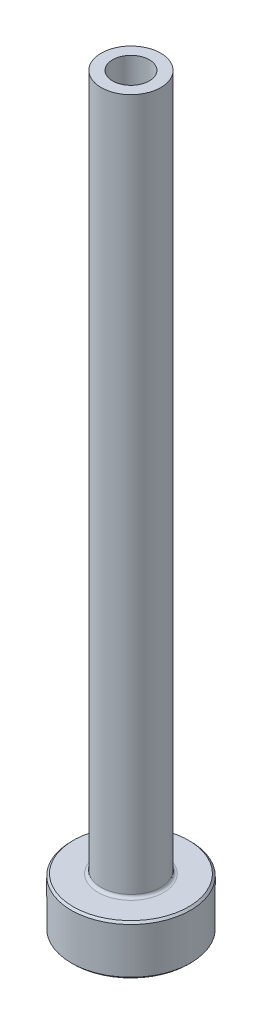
from build123d import *

# Parameters (mm, degrees)
FILLET1_R     = 0.3
CHAMFER1_SIZE = 0.2
CHAMFER3_SIZE = 0.5


with BuildPart() as part:
    # Sketch1 → Revolve1 (revolve)
    with BuildSketch(Plane.XY, mode=Mode.PRIVATE) as revolve1_sk:
        Polygon((-1.85, 75), (-3, 75), (-3, 5), (-6, 5), (-6, 0), (-2.1, 0), (-2.1, 18), (-1.85, 30), align=None)
    revolve(revolve1_sk.sketch.rotate(Axis((0, 92.187680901, 0), (0, -1, 0)), 270), axis=Axis((0, 92.187680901, 0), (0, -1, 0)))

    # Fillet1
    fillet1_edges = [part.edges().sort_by_distance(p)[0] for p in [
        (0, 5, -3),
    ]]
    fillet(fillet1_edges, radius=FILLET1_R)

    # Chamfer1
    chamfer1_edges = [part.edges().sort_by_distance(p)[0] for p in [
        (0, 0, -6),
        (0, 5, -6),
    ]]
    chamfer(chamfer1_edges, length=CHAMFER1_SIZE)

    # Chamfer3
    chamfer3_edges = [part.edges().sort_by_distance(p)[0] for p in [
        (0, 0, -2.1),
    ]]
    chamfer(chamfer3_edges, length=CHAMFER3_SIZE)


solid = part.part
